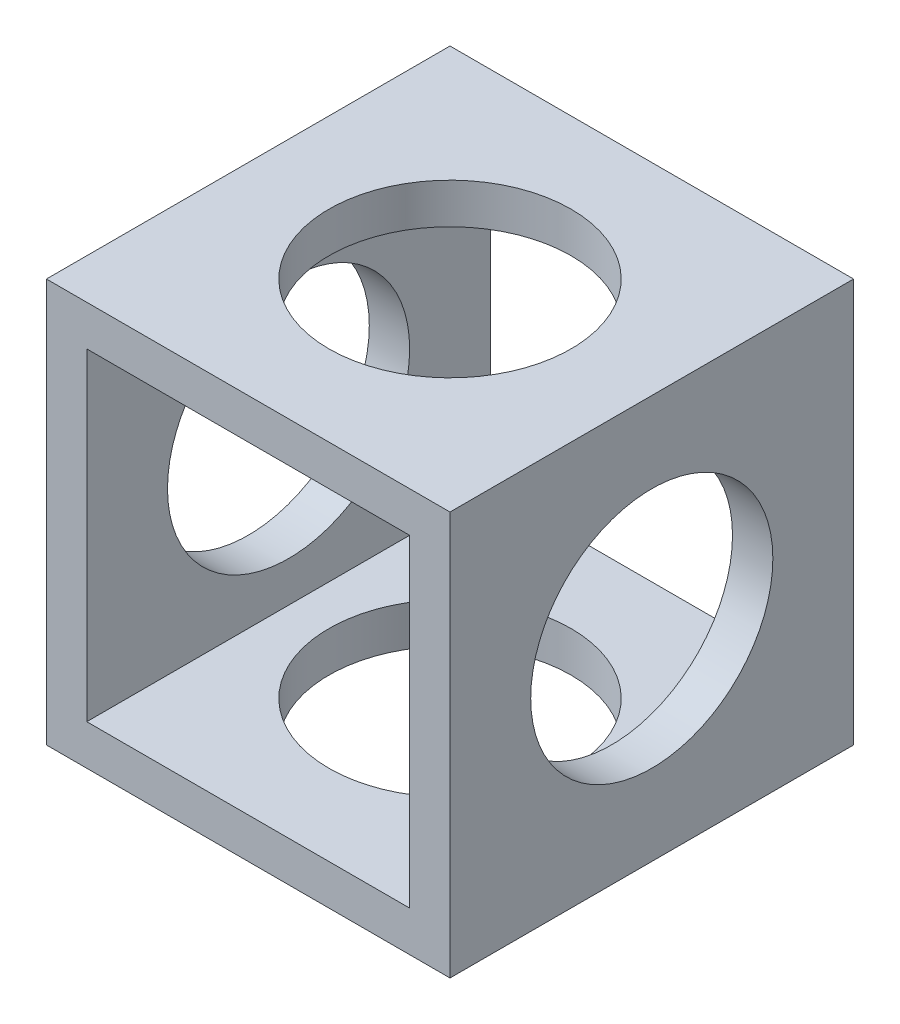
from build123d import *

# Parameters (mm, degrees)
SKETCH1_W          = 50
SKETCH1_H          = 50
SKETCH1_W_2        = 40
SKETCH1_H_2        = 40
EXTRUDE1_DEPTH     = 50
SKETCH2_R          = 15
CUT_EXTRUDE1_DEPTH = 87.602540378
SKETCH3_R          = 15
CUT_EXTRUDE2_DEPTH = 87.602540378


with BuildPart() as part:
    # Sketch1 → Extrude1 (new body)
    with BuildSketch(Plane.XY):
        with Locations((25, 25)):
            Rectangle(SKETCH1_W, SKETCH1_H)
        with Locations((25, 25)):
            Rectangle(SKETCH1_W_2, SKETCH1_H_2, mode=Mode.SUBTRACT)
    extrude(amount=-EXTRUDE1_DEPTH)

    # Sketch2 → Cut-Extrude1 (cut, through all)
    with BuildSketch(Plane(origin=(50, 0, 0), x_dir=(0, 0, -1), z_dir=(1, 0, 0))):
        with Locations((25, 25)):
            Circle(SKETCH2_R)
    extrude(amount=-CUT_EXTRUDE1_DEPTH, mode=Mode.SUBTRACT)

    # Sketch3 → Cut-Extrude2 (cut, through all)
    with BuildSketch(Plane(origin=(0, 50, 0), x_dir=(1, 0, 0), z_dir=(0, 1, 0))):
        with Locations(Location((25, 25, 0), (0, 0, 270))):
            Circle(SKETCH3_R)
    extrude(amount=-CUT_EXTRUDE2_DEPTH, mode=Mode.SUBTRACT)


solid = part.part
